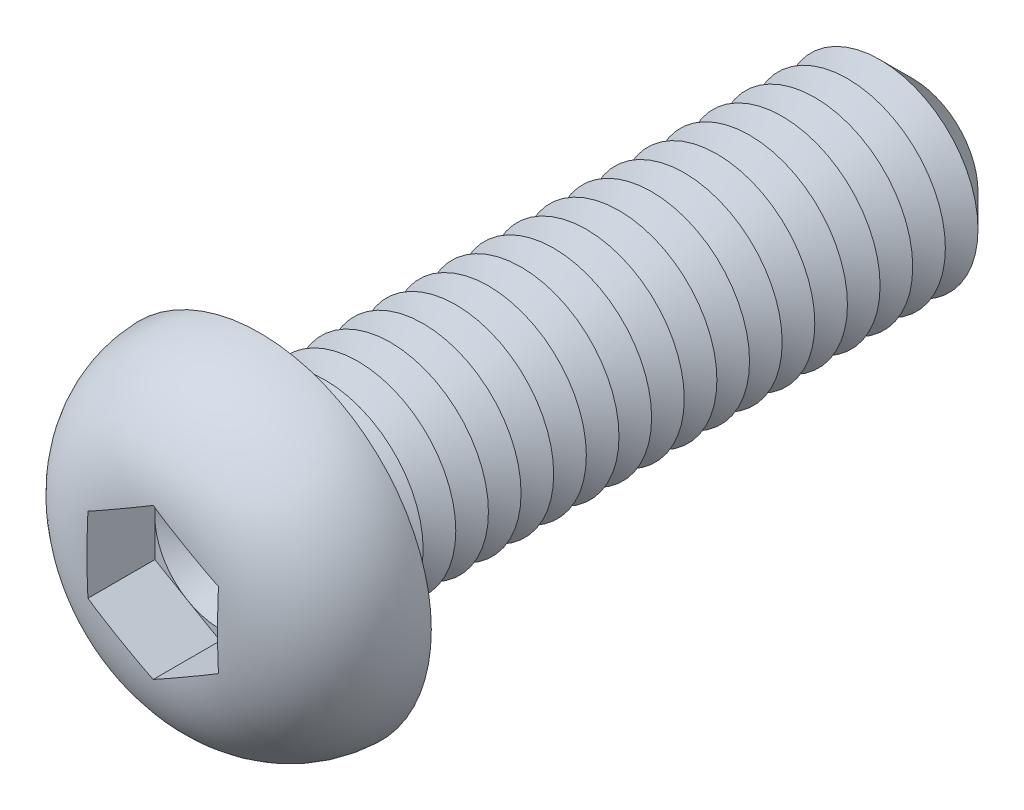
from build123d import *

# Parameters (mm, degrees)
CUT_EXTRUDE1_DEPTH  = 2.08
SKETCH4_R           = 3
BOSS_EXTRUDE1_DEPTH = 20
CHAMFER1_SIZE       = 1
LPATTERN1_COUNT     = 18
LPATTERN1_PITCH     = 1
FILLET2_R           = 0.5


with BuildPart() as part:
    # Sketch2 → Revolve1 (revolve)
    with BuildSketch(Plane(origin=(0, 0, 0), x_dir=(0, 0, -1), z_dir=(1, 0, 0)), mode=Mode.PRIVATE) as revolve1_sk:
        with BuildLine():
            Line((0, 0), (-3.3, 0))
            Line((-3.3, 0), (-3.3, 1.851470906))
            ThreePointArc((-3.3, 1.851470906), (-2.339262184, 4.220014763), (0, 5.25))
            Line((0, 5.25), (0, 0))
        make_face()
    revolve(revolve1_sk.sketch.rotate(Axis((0, 0, 47.934239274), (0, 0, -1)), 90), axis=Axis((0, 0, 47.934239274), (0, 0, -1)))

    # Sketch3 → Cut-Extrude1 (cut)
    with BuildSketch(Plane.XY.offset(3.3)):
        Polygon((0, 2.309401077), (-2, 1.154700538), (-2, -1.154700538), (0, -2.309401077), (2, -1.154700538), (2, 1.154700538), align=None)
    extrude(amount=-CUT_EXTRUDE1_DEPTH, mode=Mode.SUBTRACT)

    # Sketch4 → Boss-Extrude1 (add)
    with BuildSketch(Plane(origin=(0, 0, 0), x_dir=(-1, 0, 0), z_dir=(0, 0, -1))):
        Circle(SKETCH4_R)
    extrude(amount=BOSS_EXTRUDE1_DEPTH)

    # Chamfer1
    chamfer1_edges = [part.edges().sort_by_distance(p)[0] for p in [
        (3, 0, -20),
    ]]
    chamfer(chamfer1_edges, length=CHAMFER1_SIZE)

    # Sketch5 → Cut-Revolve1 (revolve, cut)
    with BuildSketch(Plane(origin=(0, 0, 0), x_dir=(0, 0, -1), z_dir=(1, 0, 0)), mode=Mode.PRIVATE) as cut_revolve1_sk:
        Polygon((1, 3), (2, 3), (1.5, 2.133974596), align=None)
    cut_revolve1 = revolve(cut_revolve1_sk.sketch.rotate(Axis((0, 0, 47.934239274), (0, 0, -1)), 90), axis=Axis((0, 0, 47.934239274), (0, 0, -1)), mode=Mode.SUBTRACT)

    # LPattern1: Cut-Revolve1 ×18
    with Locations(*[(0, 0, -i * LPATTERN1_PITCH) for i in range(1, LPATTERN1_COUNT)]):
        add(cut_revolve1, mode=Mode.SUBTRACT)

    # Fillet2
    fillet2_edges = [part.edges().sort_by_distance(p)[0] for p in [
        (3, 0, 0),
    ]]
    fillet(fillet2_edges, radius=FILLET2_R)

    # Cut-Extrude2 cone 1 section (on through the dimple's axis) → Cut-Extrude2 (revolve, cut)
    with BuildSketch(Plane(origin=(0, 0, 1.22), x_dir=(0, -1, 0), z_dir=(1, 0, 0))):
        Polygon((0, 0), (2, 0), (0, 1.154700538), align=None)
    revolve(axis=Axis((0, 0, 1.22), (0, 0, -1)), mode=Mode.SUBTRACT)


solid = part.part
